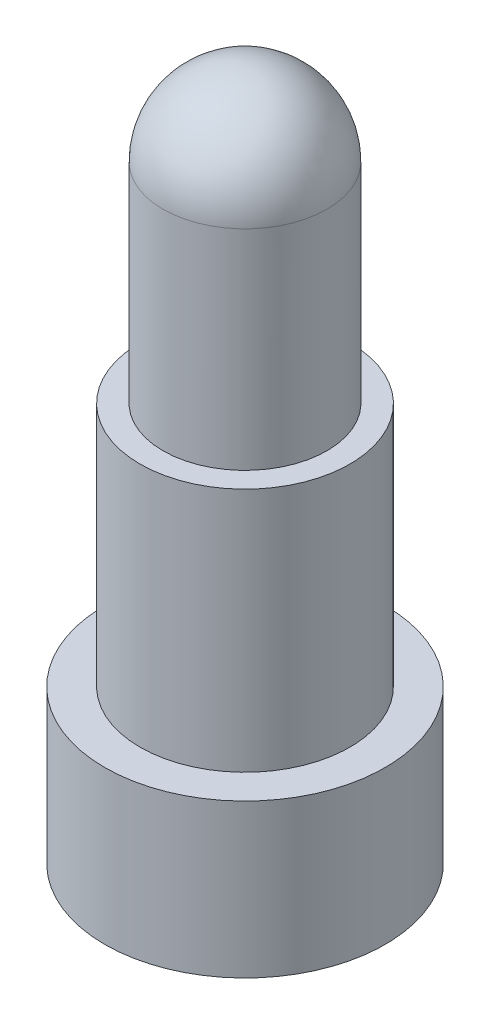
ISO-10303-21;
HEADER;
FILE_DESCRIPTION(('STEP AP214'),'2;1');
FILE_NAME('part.step','',(''),(''),'','','');
FILE_SCHEMA(('AUTOMOTIVE_DESIGN { 1 0 10303 214 1 1 1 1 }'));
ENDSEC;
DATA;
#1=APPLICATION_CONTEXT('core data for automotive mechanical design processes');
#2=APPLICATION_PROTOCOL_DEFINITION('international standard','automotive_design',2000,#1);
#3=PRODUCT_CONTEXT('',#1,'mechanical');
#4=PRODUCT('Part','Part','',(#3));
#5=PRODUCT_RELATED_PRODUCT_CATEGORY('part','',(#4));
#6=PRODUCT_DEFINITION_FORMATION('','',#4);
#7=PRODUCT_DEFINITION_CONTEXT('part definition',#1,'design');
#8=PRODUCT_DEFINITION('design','',#6,#7);
#9=PRODUCT_DEFINITION_SHAPE('','',#8);
#10=(LENGTH_UNIT() NAMED_UNIT(*) SI_UNIT(.MILLI.,.METRE.));
#11=(NAMED_UNIT(*) PLANE_ANGLE_UNIT() SI_UNIT($,.RADIAN.));
#12=(NAMED_UNIT(*) SI_UNIT($,.STERADIAN.) SOLID_ANGLE_UNIT());
#13=UNCERTAINTY_MEASURE_WITH_UNIT(LENGTH_MEASURE(1.E-05),#10,'distance_accuracy_value','');
#14=(GEOMETRIC_REPRESENTATION_CONTEXT(3) GLOBAL_UNCERTAINTY_ASSIGNED_CONTEXT((#13)) GLOBAL_UNIT_ASSIGNED_CONTEXT((#10,
#11,#12)) REPRESENTATION_CONTEXT('',''));
#15=CARTESIAN_POINT('',(0.,0.,0.));
#16=DIRECTION('',(0.,0.,1.));
#17=DIRECTION('',(1.,0.,0.));
#18=AXIS2_PLACEMENT_3D('',#15,#16,#17);
#19=CARTESIAN_POINT('',(0.,3.965,0.));
#20=DIRECTION('',(0.,1.,0.));
#21=DIRECTION('',(1.,0.,0.));
#22=AXIS2_PLACEMENT_3D('',#19,#20,#21);
#23=SPHERICAL_SURFACE('',#22,0.535);
#24=CARTESIAN_POINT('',(0.,3.965,0.));
#25=DIRECTION('',(0.,1.,0.));
#26=DIRECTION('',(0.,0.,1.));
#27=AXIS2_PLACEMENT_3D('',#24,#25,#26);
#28=CIRCLE('',#27,0.535);
#29=CARTESIAN_POINT('',(0.,3.965,0.535));
#30=VERTEX_POINT('',#29);
#31=EDGE_CURVE('E10',#30,#30,#28,.T.);
#32=ORIENTED_EDGE('',*,*,#31,.T.);
#33=EDGE_LOOP('',(#32));
#34=FACE_BOUND('',#33,.T.);
#35=ADVANCED_FACE('F43',(#34),#23,.T.);
#36=CARTESIAN_POINT('',(0.,4.5,0.));
#37=DIRECTION('',(0.,1.,0.));
#38=DIRECTION('',(0.,0.,1.));
#39=AXIS2_PLACEMENT_3D('',#36,#37,#38);
#40=CYLINDRICAL_SURFACE('',#39,0.535);
#41=CARTESIAN_POINT('',(0.,2.6,0.));
#42=DIRECTION('',(0.,1.,0.));
#43=DIRECTION('',(0.,0.,1.));
#44=AXIS2_PLACEMENT_3D('',#41,#42,#43);
#45=CIRCLE('',#44,0.535);
#46=CARTESIAN_POINT('',(0.,2.6,0.535));
#47=VERTEX_POINT('',#46);
#48=EDGE_CURVE('E50',#47,#47,#45,.T.);
#49=ORIENTED_EDGE('',*,*,#48,.T.);
#50=EDGE_LOOP('',(#49));
#51=FACE_BOUND('',#50,.T.);
#52=ORIENTED_EDGE('',*,*,#31,.F.);
#53=EDGE_LOOP('',(#52));
#54=FACE_BOUND('',#53,.T.);
#55=ADVANCED_FACE('F87',(#51,#54),#40,.T.);
#56=CARTESIAN_POINT('',(-0.685,2.6,0.));
#57=DIRECTION('',(0.,1.,0.));
#58=DIRECTION('',(0.,0.,1.));
#59=AXIS2_PLACEMENT_3D('',#56,#57,#58);
#60=PLANE('',#59);
#61=CARTESIAN_POINT('',(0.,2.6,0.));
#62=DIRECTION('',(0.,1.,0.));
#63=DIRECTION('',(0.,0.,1.));
#64=AXIS2_PLACEMENT_3D('',#61,#62,#63);
#65=CIRCLE('',#64,0.685);
#66=CARTESIAN_POINT('',(0.,2.6,0.685));
#67=VERTEX_POINT('',#66);
#68=EDGE_CURVE('E55',#67,#67,#65,.T.);
#69=ORIENTED_EDGE('',*,*,#68,.T.);
#70=EDGE_LOOP('',(#69));
#71=FACE_BOUND('',#70,.T.);
#72=ORIENTED_EDGE('',*,*,#48,.F.);
#73=EDGE_LOOP('',(#72));
#74=FACE_BOUND('',#73,.T.);
#75=ADVANCED_FACE('F91',(#71,#74),#60,.T.);
#76=CARTESIAN_POINT('',(0.,4.5,0.));
#77=DIRECTION('',(0.,1.,0.));
#78=DIRECTION('',(0.,0.,1.));
#79=AXIS2_PLACEMENT_3D('',#76,#77,#78);
#80=CYLINDRICAL_SURFACE('',#79,0.685);
#81=CARTESIAN_POINT('',(0.,1.,0.));
#82=DIRECTION('',(0.,1.,0.));
#83=DIRECTION('',(0.,0.,1.));
#84=AXIS2_PLACEMENT_3D('',#81,#82,#83);
#85=CIRCLE('',#84,0.685);
#86=CARTESIAN_POINT('',(0.,1.,0.685));
#87=VERTEX_POINT('',#86);
#88=EDGE_CURVE('E60',#87,#87,#85,.T.);
#89=ORIENTED_EDGE('',*,*,#88,.T.);
#90=EDGE_LOOP('',(#89));
#91=FACE_BOUND('',#90,.T.);
#92=ORIENTED_EDGE('',*,*,#68,.F.);
#93=EDGE_LOOP('',(#92));
#94=FACE_BOUND('',#93,.T.);
#95=ADVANCED_FACE('F95',(#91,#94),#80,.T.);
#96=CARTESIAN_POINT('',(-0.915,1.,0.));
#97=DIRECTION('',(0.,1.,0.));
#98=DIRECTION('',(0.,0.,1.));
#99=AXIS2_PLACEMENT_3D('',#96,#97,#98);
#100=PLANE('',#99);
#101=CARTESIAN_POINT('',(0.,1.,0.));
#102=DIRECTION('',(0.,1.,0.));
#103=DIRECTION('',(0.,0.,1.));
#104=AXIS2_PLACEMENT_3D('',#101,#102,#103);
#105=CIRCLE('',#104,0.915);
#106=CARTESIAN_POINT('',(0.,1.,0.915));
#107=VERTEX_POINT('',#106);
#108=EDGE_CURVE('E66',#107,#107,#105,.T.);
#109=ORIENTED_EDGE('',*,*,#108,.T.);
#110=EDGE_LOOP('',(#109));
#111=FACE_BOUND('',#110,.T.);
#112=ORIENTED_EDGE('',*,*,#88,.F.);
#113=EDGE_LOOP('',(#112));
#114=FACE_BOUND('',#113,.T.);
#115=ADVANCED_FACE('F84',(#111,#114),#100,.T.);
#116=CARTESIAN_POINT('',(0.,4.5,0.));
#117=DIRECTION('',(0.,1.,0.));
#118=DIRECTION('',(0.,0.,1.));
#119=AXIS2_PLACEMENT_3D('',#116,#117,#118);
#120=CYLINDRICAL_SURFACE('',#119,0.915);
#121=CARTESIAN_POINT('',(0.,0.,0.));
#122=DIRECTION('',(0.,1.,0.));
#123=DIRECTION('',(0.,0.,1.));
#124=AXIS2_PLACEMENT_3D('',#121,#122,#123);
#125=CIRCLE('',#124,0.915);
#126=CARTESIAN_POINT('',(0.,0.,0.915));
#127=VERTEX_POINT('',#126);
#128=EDGE_CURVE('E70',#127,#127,#125,.T.);
#129=ORIENTED_EDGE('',*,*,#128,.T.);
#130=EDGE_LOOP('',(#129));
#131=FACE_BOUND('',#130,.T.);
#132=ORIENTED_EDGE('',*,*,#108,.F.);
#133=EDGE_LOOP('',(#132));
#134=FACE_BOUND('',#133,.T.);
#135=ADVANCED_FACE('F75',(#131,#134),#120,.T.);
#136=CARTESIAN_POINT('',(0.,0.,0.));
#137=DIRECTION('',(0.,-1.,0.));
#138=DIRECTION('',(0.,0.,-1.));
#139=AXIS2_PLACEMENT_3D('',#136,#137,#138);
#140=PLANE('',#139);
#141=ORIENTED_EDGE('',*,*,#128,.F.);
#142=EDGE_LOOP('',(#141));
#143=FACE_BOUND('',#142,.T.);
#144=ADVANCED_FACE('F78',(#143),#140,.T.);
#145=CLOSED_SHELL('',(#35,#55,#75,#95,#115,#135,#144));
#146=MANIFOLD_SOLID_BREP('B2',#145);
#147=ADVANCED_BREP_SHAPE_REPRESENTATION('',(#18,#146),#14);
#148=SHAPE_DEFINITION_REPRESENTATION(#9,#147);
ENDSEC;
END-ISO-10303-21;
